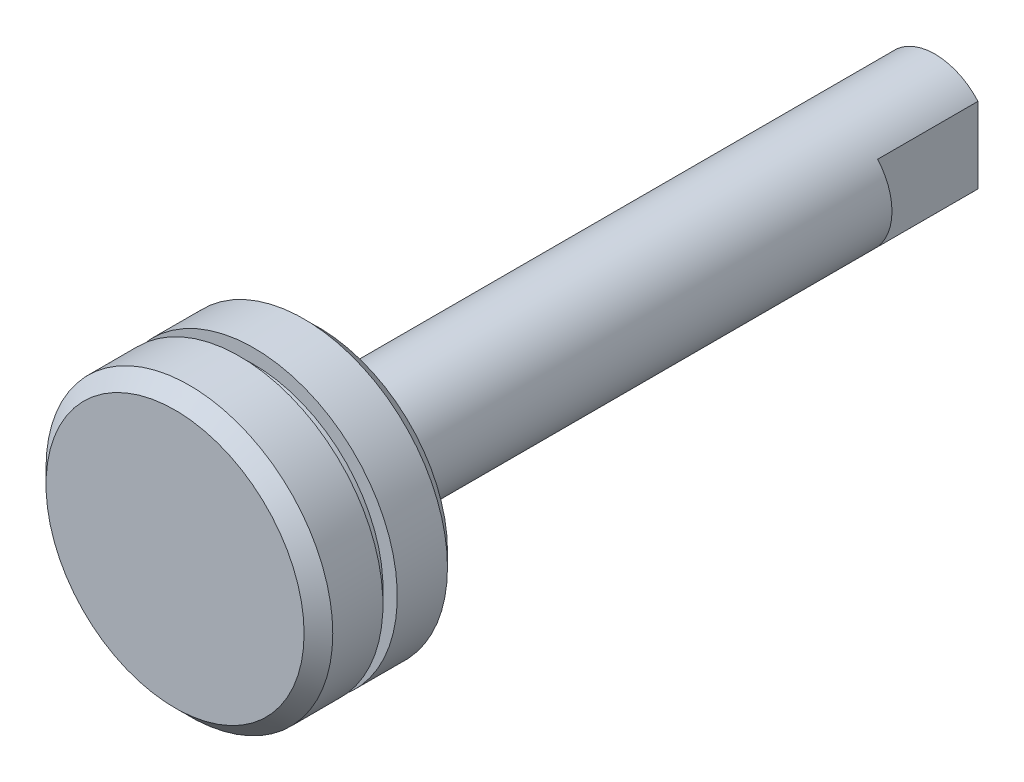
from build123d import *

# Parameters (mm, degrees)
ESQUISSE1_R               = 4
BASE_EXTRUSION_DEPTH      = 43
ESQUISSE2_R               = 10
BOSS_EXTRU_1_DEPTH        = 10
ESQUISSE4_W               = 3.314228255
ESQUISSE4_H               = 8.012066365
ESQUISSE4_W_2             = 3.056812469
ESQUISSE4_H_2             = 8.269482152
ENL_V_MAT_EXTRU_1_DEPTH   = 7
CHANFREIN2_SIZE           = 1
ESQUISSE6_W               = 1
ESQUISSE6_H               = 1
TROU_TARAUD_M5X0_81_D     = 4.2
TROU_TARAUD_M5X0_81_DEPTH = 19
TROU_TARAUD_M5X0_81_TIP   = 1.2618073
ESQUISSE10_R              = 7.5
ESQUISSE10_R_2            = 6.5
ENL_V_MAT_EXTRU_2_DEPTH   = 2


with BuildPart() as part:
    # Esquisse1 → Base-Extrusion (new body)
    with BuildSketch(Plane.XY):
        Circle(ESQUISSE1_R)
    extrude(amount=BASE_EXTRUSION_DEPTH)

    # Esquisse2 → Boss.-Extru.1 (add)
    with BuildSketch(Plane.XY.offset(43)):
        Circle(ESQUISSE2_R)
    extrude(amount=BOSS_EXTRU_1_DEPTH)

    # Esquisse4 → Enl_v. mat.-Extru.1 (cut)
    with BuildSketch(Plane(origin=(0, 0, 0), x_dir=(-1, 0, 0), z_dir=(0, 0, -1))):
        with Locations((4.657114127, 0.096530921)):
            Rectangle(ESQUISSE4_W, ESQUISSE4_H)
        with Locations((-4.528406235, -0.032176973)):
            Rectangle(ESQUISSE4_W_2, ESQUISSE4_H_2)
    extrude(amount=-ENL_V_MAT_EXTRU_1_DEPTH, mode=Mode.SUBTRACT)

    # Chanfrein2
    chanfrein2_edges = [part.edges().sort_by_distance(p)[0] for p in [
        (-10, 0, 43),
        (-10, 0, 53),
    ]]
    chamfer(chanfrein2_edges, length=CHANFREIN2_SIZE)

    # Esquisse6 → Enl_vement de mati_re-R_volution2 (revolve, cut)
    with BuildSketch(Plane(origin=(0, 0, 0), x_dir=(0, 0, -1), z_dir=(1, 0, 0)), mode=Mode.PRIVATE) as enl_vement_de_mati_re_r_volution2_sk:
        with Locations((-48, 9.5)):
            Rectangle(ESQUISSE6_W, ESQUISSE6_H)
    revolve(enl_vement_de_mati_re_r_volution2_sk.sketch.rotate(Axis((0, 0, 53), (0, 0, 1)), 90), axis=Axis((0, 0, 53), (0, 0, 1)), mode=Mode.SUBTRACT)

    # Trou taraud_ M5x0.81
    with Locations(Plane(origin=(0, 0, 0), x_dir=(-1, 0, 0), z_dir=(0, 0, -1))):
        with Locations((0, 0)):
            Hole(TROU_TARAUD_M5X0_81_D / 2, depth=TROU_TARAUD_M5X0_81_DEPTH)
            with Locations((0, 0, -(TROU_TARAUD_M5X0_81_DEPTH + TROU_TARAUD_M5X0_81_TIP / 2))):  # 118° drill point
                Cone(0, TROU_TARAUD_M5X0_81_D / 2, TROU_TARAUD_M5X0_81_TIP, mode=Mode.SUBTRACT)

    # Esquisse10 → Enl_v. mat.-Extru.2 (cut)
    with BuildSketch(Plane(origin=(0, 0, 43), x_dir=(-1, 0, 0), z_dir=(0, 0, -1))):
        Circle(ESQUISSE10_R)
        Circle(ESQUISSE10_R_2, mode=Mode.SUBTRACT)
    extrude(amount=-ENL_V_MAT_EXTRU_2_DEPTH, mode=Mode.SUBTRACT)


solid = part.part
